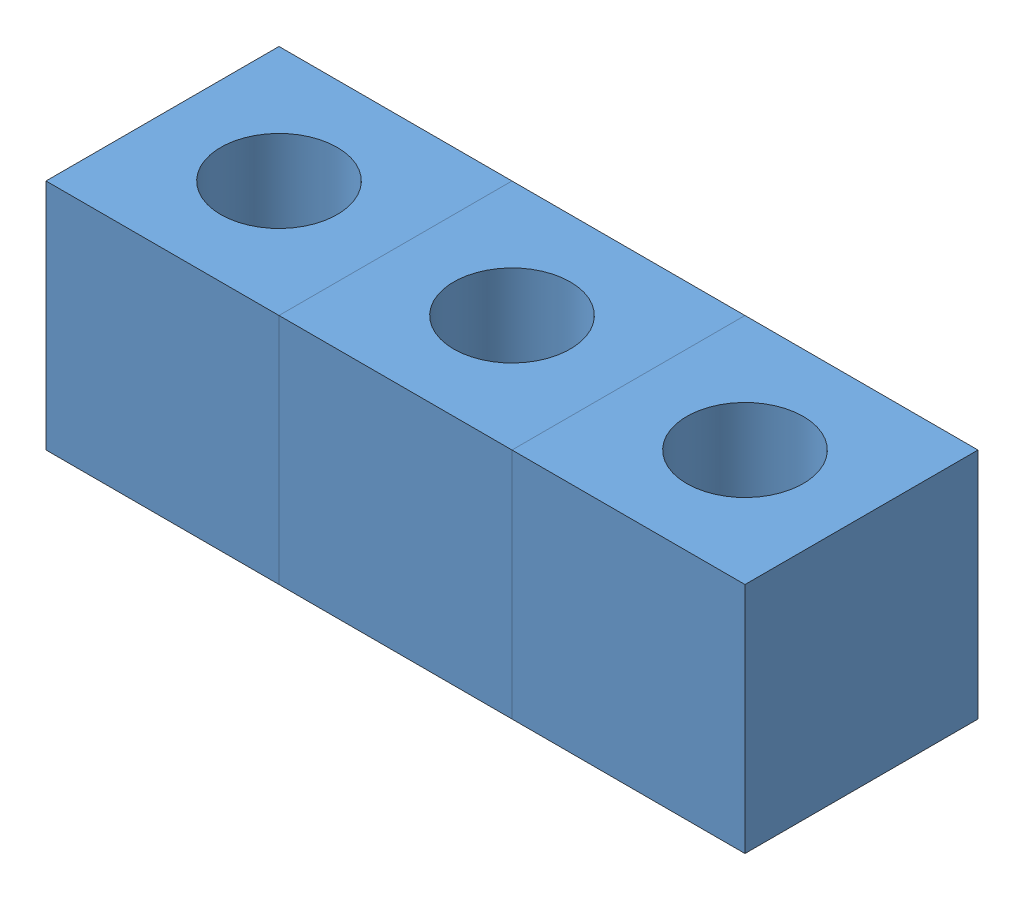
SolidWorks assembly SmartMate-Drag-Drop.SLDASM, configuration Default (file format 4628). Lengths in mm.
Overall size (304.8 101.6 101.6).
3 component instances, 1 part files, 6 mates.
Components (placement in the parent):
- Block w Thru Hole-1: Block w Thru Hole.SLDPRT [Default] at origin size (101.6 101.6 101.6)
- Block w Thru Hole-2: Block w Thru Hole.SLDPRT [Default] at (101.6 0 0) size (101.6 101.6 101.6)
- Block w Thru Hole-3: Block w Thru Hole.SLDPRT [Default] at (203.2 0 0) size (101.6 101.6 101.6)
Mates (geometry in assembly coordinates):
- Coincident1: coincident aligned: plane of Block w Thru Hole-1 through (0 101.6 101.6) normal (0 1 0); plane of Block w Thru Hole-2 through (101.6 101.6 101.6) normal (0 1 0)
- Coincident2: coincident aligned: plane of Block w Thru Hole-2 through (101.6 101.6 101.6) normal (0 1 0); plane of Block w Thru Hole-3 through (203.2 101.6 101.6) normal (0 1 0)
- Coincident3: coincident aligned: plane of Block w Thru Hole-1 through (0 101.6 101.6) normal (0 0 1); plane of Block w Thru Hole-2 through (101.6 101.6 101.6) normal (0 0 1)
- Coincident4: coincident aligned: plane of Block w Thru Hole-2 through (101.6 101.6 101.6) normal (0 0 1); plane of Block w Thru Hole-3 through (203.2 101.6 101.6) normal (0 0 1)
- Coincident5: coincident: plane of Block w Thru Hole-2 through (203.2 0 101.6) normal (1 0 0); point of Block w Thru Hole-3
- Coincident6: coincident: plane of Block w Thru Hole-1 through (101.6 0 101.6) normal (1 0 0); point of Block w Thru Hole-2
